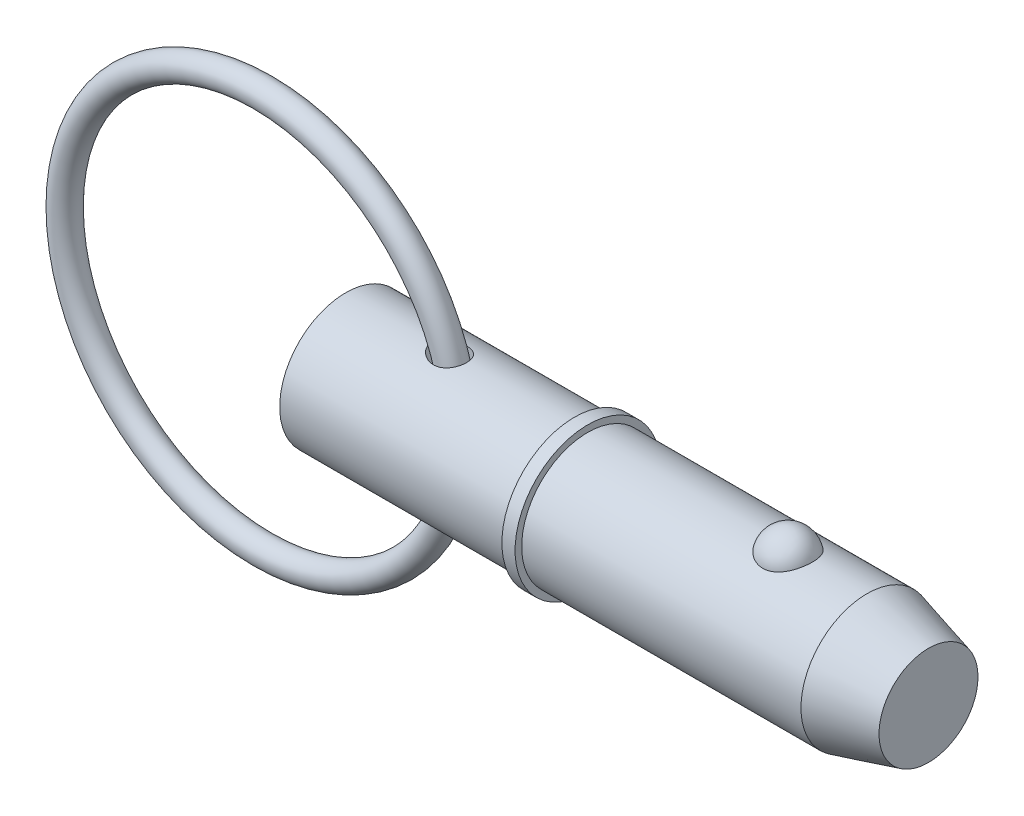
ISO-10303-21;
HEADER;
FILE_DESCRIPTION(('STEP AP214'),'2;1');
FILE_NAME('part.step','',(''),(''),'','','');
FILE_SCHEMA(('AUTOMOTIVE_DESIGN { 1 0 10303 214 1 1 1 1 }'));
ENDSEC;
DATA;
#1=APPLICATION_CONTEXT('core data for automotive mechanical design processes');
#2=APPLICATION_PROTOCOL_DEFINITION('international standard','automotive_design',2000,#1);
#3=PRODUCT_CONTEXT('',#1,'mechanical');
#4=PRODUCT('Part','Part','',(#3));
#5=PRODUCT_RELATED_PRODUCT_CATEGORY('part','',(#4));
#6=PRODUCT_DEFINITION_FORMATION('','',#4);
#7=PRODUCT_DEFINITION_CONTEXT('part definition',#1,'design');
#8=PRODUCT_DEFINITION('design','',#6,#7);
#9=PRODUCT_DEFINITION_SHAPE('','',#8);
#10=(LENGTH_UNIT() NAMED_UNIT(*) SI_UNIT(.MILLI.,.METRE.));
#11=(NAMED_UNIT(*) PLANE_ANGLE_UNIT() SI_UNIT($,.RADIAN.));
#12=(NAMED_UNIT(*) SI_UNIT($,.STERADIAN.) SOLID_ANGLE_UNIT());
#13=UNCERTAINTY_MEASURE_WITH_UNIT(LENGTH_MEASURE(1.E-05),#10,'distance_accuracy_value','');
#14=(GEOMETRIC_REPRESENTATION_CONTEXT(3) GLOBAL_UNCERTAINTY_ASSIGNED_CONTEXT((#13)) GLOBAL_UNIT_ASSIGNED_CONTEXT((#10,
#11,#12)) REPRESENTATION_CONTEXT('',''));
#15=CARTESIAN_POINT('',(0.,0.,0.));
#16=DIRECTION('',(0.,0.,1.));
#17=DIRECTION('',(1.,0.,0.));
#18=AXIS2_PLACEMENT_3D('',#15,#16,#17);
#19=CARTESIAN_POINT('',(-11.9894358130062,0.,0.));
#20=DIRECTION('',(0.,0.,1.));
#21=DIRECTION('',(1.,0.,0.));
#22=AXIS2_PLACEMENT_3D('',#19,#20,#21);
#23=TOROIDAL_SURFACE('',#22,28.575,1.905);
#24=CARTESIAN_POINT('',(18.4905641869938,0.,0.));
#25=VERTEX_POINT('',#24);
#26=VERTEX_LOOP('',#25);
#27=FACE_BOUND('',#26,.T.);
#28=ADVANCED_FACE('P0_F12',(#27),#23,.T.);
#29=CLOSED_SHELL('',(#28));
#30=MANIFOLD_SOLID_BREP('P0_B1',#29);
#31=CARTESIAN_POINT('',(0.,0.,0.));
#32=DIRECTION('',(1.,0.,0.));
#33=DIRECTION('',(0.,0.,-1.));
#34=AXIS2_PLACEMENT_3D('',#31,#32,#33);
#35=CYLINDRICAL_SURFACE('',#34,9.525);
#36=CARTESIAN_POINT('',(12.9513882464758,9.41921920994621,-1.41559473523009));
#37=CARTESIAN_POINT('',(13.0504692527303,9.40163924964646,-1.53256769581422));
#38=CARTESIAN_POINT('',(13.1602600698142,9.38319823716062,-1.6404459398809));
#39=CARTESIAN_POINT('',(13.3966485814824,9.34687220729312,-1.83618480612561));
#40=CARTESIAN_POINT('',(13.5232761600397,9.32898824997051,-1.92400906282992));
#41=CARTESIAN_POINT('',(13.78900694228,9.29593183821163,-2.07784697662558));
#42=CARTESIAN_POINT('',(13.9280753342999,9.28075215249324,-2.14391921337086));
#43=CARTESIAN_POINT('',(14.2153444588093,9.25488828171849,-2.25295850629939));
#44=CARTESIAN_POINT('',(14.3635415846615,9.24420233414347,-2.29593462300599));
#45=CARTESIAN_POINT('',(14.669669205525,9.22859713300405,-2.3579005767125));
#46=CARTESIAN_POINT('',(14.8277567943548,9.22385123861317,-2.37617053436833));
#47=CARTESIAN_POINT('',(15.1447573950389,9.22170813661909,-2.38448481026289));
#48=CARTESIAN_POINT('',(15.3036699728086,9.22430739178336,-2.3745427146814));
#49=CARTESIAN_POINT('',(15.6046561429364,9.2363636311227,-2.32717331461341));
#50=CARTESIAN_POINT('',(15.7470893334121,9.24528216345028,-2.29190131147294));
#51=CARTESIAN_POINT('',(16.0228763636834,9.26842607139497,-2.19642882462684));
#52=CARTESIAN_POINT('',(16.1562346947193,9.28264879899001,-2.1362407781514));
#53=CARTESIAN_POINT('',(16.3991522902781,9.31332263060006,-1.99805318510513));
#54=CARTESIAN_POINT('',(16.5097585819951,9.32951023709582,-1.92182839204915));
#55=CARTESIAN_POINT('',(16.7159974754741,9.36298467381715,-1.75147176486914));
#56=CARTESIAN_POINT('',(16.811631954,9.38027136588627,-1.65734217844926));
#57=CARTESIAN_POINT('',(16.9833240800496,9.41356881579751,-1.45618916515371));
#58=CARTESIAN_POINT('',(17.0597719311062,9.42959946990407,-1.34950141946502));
#59=CARTESIAN_POINT('',(17.1939538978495,9.45905380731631,-1.12462011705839));
#60=CARTESIAN_POINT('',(17.2516877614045,9.4724774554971,-1.00642640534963));
#61=CARTESIAN_POINT('',(17.3474400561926,9.49535683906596,-0.760990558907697));
#62=CARTESIAN_POINT('',(17.3853184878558,9.50478431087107,-0.633691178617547));
#63=CARTESIAN_POINT('',(17.4399027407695,9.51852575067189,-0.374363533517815));
#64=CARTESIAN_POINT('',(17.4566077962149,9.52283953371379,-0.242335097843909));
#65=CARTESIAN_POINT('',(17.4685150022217,9.52590431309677,0.0235692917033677));
#66=CARTESIAN_POINT('',(17.4635842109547,9.52462091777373,0.157451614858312));
#67=CARTESIAN_POINT('',(17.4320243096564,9.5165501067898,0.422467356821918));
#68=CARTESIAN_POINT('',(17.4053947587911,9.50976257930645,0.55360071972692));
#69=CARTESIAN_POINT('',(17.3310009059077,9.49140797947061,0.809490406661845));
#70=CARTESIAN_POINT('',(17.2832204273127,9.47983724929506,0.934241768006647));
#71=CARTESIAN_POINT('',(17.1676219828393,9.453180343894,1.1736825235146));
#72=CARTESIAN_POINT('',(17.0998044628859,9.43809424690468,1.28837214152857));
#73=CARTESIAN_POINT('',(16.9461013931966,9.40614962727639,1.50393386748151));
#74=CARTESIAN_POINT('',(16.8602910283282,9.38929862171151,1.6048606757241));
#75=CARTESIAN_POINT('',(16.6726759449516,9.35566510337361,1.79055313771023));
#76=CARTESIAN_POINT('',(16.5708731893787,9.33888258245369,1.87532077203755));
#77=CARTESIAN_POINT('',(16.3550631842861,9.30741331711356,2.02572386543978));
#78=CARTESIAN_POINT('',(16.2411701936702,9.29270956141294,2.09151983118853));
#79=CARTESIAN_POINT('',(16.0037488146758,9.26681293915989,2.20343355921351));
#80=CARTESIAN_POINT('',(15.8802207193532,9.25561996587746,2.24955191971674));
#81=CARTESIAN_POINT('',(15.6262451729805,9.23779438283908,2.32167613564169));
#82=CARTESIAN_POINT('',(15.4957570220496,9.23119272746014,2.34754561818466));
#83=CARTESIAN_POINT('',(15.2322153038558,9.22318493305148,2.37881082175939));
#84=CARTESIAN_POINT('',(15.0991611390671,9.22178001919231,2.38420171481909));
#85=CARTESIAN_POINT('',(14.8267609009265,9.22414647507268,2.37503099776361));
#86=CARTESIAN_POINT('',(14.6874545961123,9.22819578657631,2.35939810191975));
#87=CARTESIAN_POINT('',(14.412976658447,9.24129253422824,2.30756034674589));
#88=CARTESIAN_POINT('',(14.2778066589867,9.25034191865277,2.27134746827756));
#89=CARTESIAN_POINT('',(14.0027915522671,9.27334688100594,2.1756145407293));
#90=CARTESIAN_POINT('',(13.8635960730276,9.28766658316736,2.11431132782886));
#91=CARTESIAN_POINT('',(13.5969045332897,9.31925368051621,1.97041856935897));
#92=CARTESIAN_POINT('',(13.4694182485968,9.33652350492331,1.88781145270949));
#93=CARTESIAN_POINT('',(13.2243568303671,9.37286659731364,1.69844580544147));
#94=CARTESIAN_POINT('',(13.1075060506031,9.39198626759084,1.59075211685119));
#95=CARTESIAN_POINT('',(12.8957171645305,9.42881110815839,1.35544651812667));
#96=CARTESIAN_POINT('',(12.8007455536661,9.44651841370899,1.22786557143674));
#97=CARTESIAN_POINT('',(12.6580495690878,9.4741137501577,0.9887243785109));
#98=CARTESIAN_POINT('',(12.604453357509,9.4848570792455,0.880756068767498));
#99=CARTESIAN_POINT('',(12.515693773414,9.50295777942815,0.657225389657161));
#100=CARTESIAN_POINT('',(12.4805142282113,9.51031812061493,0.541669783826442));
#101=CARTESIAN_POINT('',(12.4305797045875,9.52083647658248,0.305475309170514));
#102=CARTESIAN_POINT('',(12.4159122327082,9.52397648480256,0.18481691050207));
#103=CARTESIAN_POINT('',(12.408320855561,9.52559626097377,-0.0572308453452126));
#104=CARTESIAN_POINT('',(12.4153963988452,9.52407614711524,-0.178620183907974));
#105=CARTESIAN_POINT('',(12.4495068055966,9.51684301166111,-0.409566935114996));
#106=CARTESIAN_POINT('',(12.4750931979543,9.51143444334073,-0.519353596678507));
#107=CARTESIAN_POINT('',(12.543120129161,9.49733710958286,-0.73328523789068));
#108=CARTESIAN_POINT('',(12.5855568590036,9.4886490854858,-0.837431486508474));
#109=CARTESIAN_POINT('',(12.6780792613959,9.47023833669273,-1.02356028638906));
#110=CARTESIAN_POINT('',(12.7261842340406,9.46084463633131,-1.10657511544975));
#111=CARTESIAN_POINT('',(12.8319313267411,9.44081892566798,-1.26610577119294));
#112=CARTESIAN_POINT('',(12.8895756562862,9.43018662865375,-1.34262008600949));
#113=CARTESIAN_POINT('',(12.9513882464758,9.41921920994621,-1.41559473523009));
#114=B_SPLINE_CURVE_WITH_KNOTS('',3,(#36,#37,#38,#39,#40,#41,#42,#43,#44,#45,#46,#47,#48,#49,
#50,#51,#52,#53,#54,#55,#56,#57,#58,#59,#60,#61,#62,#63,#64,#65,#66,#67,#68,#69,#70,#71,#72,#73,
#74,#75,#76,#77,#78,#79,#80,#81,#82,#83,#84,#85,#86,#87,#88,#89,#90,#91,#92,#93,#94,#95,#96,#97,
#98,#99,#100,#101,#102,#103,#104,#105,#106,#107,#108,#109,#110,#111,#112,#113),.UNSPECIFIED.,
.T.,.F.,(4,2,2,2,2,2,2,2,2,2,2,2,2,2,2,2,2,2,2,2,2,2,2,2,2,2,2,2,2,2,2,2,2,2,2,2,2,2,4),(0.,
0.462524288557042,0.925880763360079,1.3879789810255,1.8498957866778,2.3250010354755,
2.79987752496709,3.23851602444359,3.67693583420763,4.08084875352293,4.48471100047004,
4.87953549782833,5.27436531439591,5.67194282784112,6.0695347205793,6.46957303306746,
6.86961947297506,7.26997240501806,7.67031642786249,8.06901977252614,8.46767421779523,
8.86284969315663,9.25801315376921,9.65581560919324,10.0537118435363,10.4726706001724,
10.8917927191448,11.3481090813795,11.8048030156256,12.2824769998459,12.7594145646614,
13.1209614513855,13.4821903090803,13.8449555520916,14.2077115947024,14.5447865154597,
14.881785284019,15.170268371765,15.4588183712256),.UNSPECIFIED.);
#115=CARTESIAN_POINT('',(12.9513882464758,9.41921920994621,-1.41559473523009));
#116=VERTEX_POINT('',#115);
#117=EDGE_CURVE('P1_E42',#116,#116,#114,.T.);
#118=ORIENTED_EDGE('',*,*,#117,.T.);
#119=EDGE_LOOP('',(#118));
#120=FACE_BOUND('',#119,.T.);
#121=CARTESIAN_POINT('',(0.,0.,0.));
#122=DIRECTION('',(1.,0.,0.));
#123=DIRECTION('',(0.,0.,-1.));
#124=AXIS2_PLACEMENT_3D('',#121,#122,#123);
#125=CIRCLE('',#124,9.525);
#126=CARTESIAN_POINT('',(0.,0.,-9.525));
#127=VERTEX_POINT('',#126);
#128=EDGE_CURVE('P1_E9',#127,#127,#125,.T.);
#129=ORIENTED_EDGE('',*,*,#128,.T.);
#130=EDGE_LOOP('',(#129));
#131=FACE_BOUND('',#130,.T.);
#132=CARTESIAN_POINT('',(33.025,0.,0.));
#133=DIRECTION('',(1.,0.,0.));
#134=DIRECTION('',(0.,0.,-1.));
#135=AXIS2_PLACEMENT_3D('',#132,#133,#134);
#136=CIRCLE('',#135,9.525);
#137=CARTESIAN_POINT('',(33.025,0.,-9.525));
#138=VERTEX_POINT('',#137);
#139=EDGE_CURVE('P1_E25',#138,#138,#136,.T.);
#140=ORIENTED_EDGE('',*,*,#139,.F.);
#141=EDGE_LOOP('',(#140));
#142=FACE_BOUND('',#141,.T.);
#143=CARTESIAN_POINT('',(12.9513882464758,-9.41921920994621,-1.41559473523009));
#144=CARTESIAN_POINT('',(12.8706569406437,-9.43354320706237,-1.32028288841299));
#145=CARTESIAN_POINT('',(12.7970077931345,-9.44729974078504,-1.21890449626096));
#146=CARTESIAN_POINT('',(12.6667099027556,-9.47239055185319,-1.00546491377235));
#147=CARTESIAN_POINT('',(12.6100480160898,-9.48372669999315,-0.893412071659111));
#148=CARTESIAN_POINT('',(12.5163428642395,-9.50281544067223,-0.66020233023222));
#149=CARTESIAN_POINT('',(12.4794216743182,-9.51054569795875,-0.538993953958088));
#150=CARTESIAN_POINT('',(12.4282252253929,-9.52133525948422,-0.29167282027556));
#151=CARTESIAN_POINT('',(12.4139371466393,-9.52439720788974,-0.165562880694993));
#152=CARTESIAN_POINT('',(12.4092595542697,-9.52539668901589,0.0763263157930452));
#153=CARTESIAN_POINT('',(12.4169377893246,-9.5237485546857,0.192070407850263));
#154=CARTESIAN_POINT('',(12.4515961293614,-9.51640070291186,0.420478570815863));
#155=CARTESIAN_POINT('',(12.4785770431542,-9.51070081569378,0.533142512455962));
#156=CARTESIAN_POINT('',(12.5496371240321,-9.49599978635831,0.750537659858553));
#157=CARTESIAN_POINT('',(12.5934215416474,-9.48705569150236,0.855370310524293));
#158=CARTESIAN_POINT('',(12.6960201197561,-9.46670226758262,1.05710432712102));
#159=CARTESIAN_POINT('',(12.754838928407,-9.45529217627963,1.15400322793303));
#160=CARTESIAN_POINT('',(12.8926588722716,-9.42958102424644,1.34883014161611));
#161=CARTESIAN_POINT('',(12.9731843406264,-9.41509922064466,1.44565277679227));
#162=CARTESIAN_POINT('',(13.1473692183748,-9.38554264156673,1.62653953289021));
#163=CARTESIAN_POINT('',(13.2410364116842,-9.37046751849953,1.71059603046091));
#164=CARTESIAN_POINT('',(13.4543924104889,-9.33867330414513,1.87697964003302));
#165=CARTESIAN_POINT('',(13.5758667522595,-9.32205896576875,1.95704323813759));
#166=CARTESIAN_POINT('',(13.8299208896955,-9.29140277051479,2.09777392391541));
#167=CARTESIAN_POINT('',(13.9625074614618,-9.27736250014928,2.15842906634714));
#168=CARTESIAN_POINT('',(14.2477938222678,-9.25234849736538,2.26337318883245));
#169=CARTESIAN_POINT('',(14.4012368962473,-9.2417532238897,2.30575283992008));
#170=CARTESIAN_POINT('',(14.7134258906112,-9.22706044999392,2.36387471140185));
#171=CARTESIAN_POINT('',(14.8721705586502,-9.22296142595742,2.37962317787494));
#172=CARTESIAN_POINT('',(15.1841930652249,-9.22219798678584,2.38258156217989));
#173=CARTESIAN_POINT('',(15.3374581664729,-9.22526675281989,2.37081567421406));
#174=CARTESIAN_POINT('',(15.6390558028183,-9.23821642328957,2.31984408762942));
#175=CARTESIAN_POINT('',(15.7873916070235,-9.24809271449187,2.28065697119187));
#176=CARTESIAN_POINT('',(16.0605055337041,-9.27231045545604,2.17997072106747));
#177=CARTESIAN_POINT('',(16.1861988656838,-9.28616347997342,2.12082794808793));
#178=CARTESIAN_POINT('',(16.4248737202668,-9.31689725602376,1.9814435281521));
#179=CARTESIAN_POINT('',(16.5378583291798,-9.33377726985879,1.90120701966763));
#180=CARTESIAN_POINT('',(16.7424913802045,-9.36766057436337,1.72629138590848));
#181=CARTESIAN_POINT('',(16.8349077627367,-9.38461836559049,1.63249912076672));
#182=CARTESIAN_POINT('',(17.0025959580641,-9.41752009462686,1.43052052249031));
#183=CARTESIAN_POINT('',(17.0778684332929,-9.43346407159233,1.32233474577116));
#184=CARTESIAN_POINT('',(17.2093311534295,-9.46256896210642,1.09477833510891));
#185=CARTESIAN_POINT('',(17.2655443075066,-9.47573320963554,0.975421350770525));
#186=CARTESIAN_POINT('',(17.3577240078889,-9.49788660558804,0.728764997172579));
#187=CARTESIAN_POINT('',(17.3936897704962,-9.5068755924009,0.601465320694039));
#188=CARTESIAN_POINT('',(17.4447894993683,-9.51977728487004,0.341392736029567));
#189=CARTESIAN_POINT('',(17.4597470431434,-9.52364698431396,0.208583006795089));
#190=CARTESIAN_POINT('',(17.467935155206,-9.52575588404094,-0.0577507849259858));
#191=CARTESIAN_POINT('',(17.4611651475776,-9.52399493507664,-0.191274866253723));
#192=CARTESIAN_POINT('',(17.4259933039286,-9.51501704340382,-0.455658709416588));
#193=CARTESIAN_POINT('',(17.3975278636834,-9.50778405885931,-0.586509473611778));
#194=CARTESIAN_POINT('',(17.3195245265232,-9.48862442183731,-0.841413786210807));
#195=CARTESIAN_POINT('',(17.2699864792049,-9.47669773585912,-0.965467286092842));
#196=CARTESIAN_POINT('',(17.1510794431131,-9.44947793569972,-1.20302860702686));
#197=CARTESIAN_POINT('',(17.0817421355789,-9.43419020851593,-1.31655289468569));
#198=CARTESIAN_POINT('',(16.9249035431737,-9.40193593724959,-1.52999797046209));
#199=CARTESIAN_POINT('',(16.8374037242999,-9.38496952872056,-1.62991985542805));
#200=CARTESIAN_POINT('',(16.6472525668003,-9.35139745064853,-1.81261591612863));
#201=CARTESIAN_POINT('',(16.544718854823,-9.33479003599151,-1.89551219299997));
#202=CARTESIAN_POINT('',(16.3268885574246,-9.30366076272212,-2.04284430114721));
#203=CARTESIAN_POINT('',(16.2115933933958,-9.28913867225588,-2.10728218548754));
#204=CARTESIAN_POINT('',(15.9721327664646,-9.26380878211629,-2.21598517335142));
#205=CARTESIAN_POINT('',(15.8480095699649,-9.25298455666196,-2.26033977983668));
#206=CARTESIAN_POINT('',(15.5939970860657,-9.23601616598,-2.32870721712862));
#207=CARTESIAN_POINT('',(15.4641070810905,-9.22987258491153,-2.35271750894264));
#208=CARTESIAN_POINT('',(15.1982340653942,-9.22261892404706,-2.38099747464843));
#209=CARTESIAN_POINT('',(15.0621840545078,-9.22166165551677,-2.38466791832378));
#210=CARTESIAN_POINT('',(14.7911713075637,-9.22504733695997,-2.37153091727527));
#211=CARTESIAN_POINT('',(14.6562088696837,-9.2293916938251,-2.35471803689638));
#212=CARTESIAN_POINT('',(14.3799999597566,-9.24325361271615,-2.29972931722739));
#213=CARTESIAN_POINT('',(14.2390842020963,-9.25314817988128,-2.2599897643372));
#214=CARTESIAN_POINT('',(13.9651910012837,-9.27709186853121,-2.15959208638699));
#215=CARTESIAN_POINT('',(13.8322212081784,-9.29114491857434,-2.09891417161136));
#216=CARTESIAN_POINT('',(13.5621642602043,-9.32369066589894,-1.94960068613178));
#217=CARTESIAN_POINT('',(13.4264724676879,-9.34251276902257,-1.85849626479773));
#218=CARTESIAN_POINT('',(13.1736579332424,-9.38095091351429,-1.6535412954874));
#219=CARTESIAN_POINT('',(13.0565182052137,-9.40056620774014,-1.53971177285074));
#220=CARTESIAN_POINT('',(12.9513882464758,-9.41921920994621,-1.41559473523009));
#221=B_SPLINE_CURVE_WITH_KNOTS('',3,(#143,#144,#145,#146,#147,#148,#149,#150,#151,#152,#153,
#154,#155,#156,#157,#158,#159,#160,#161,#162,#163,#164,#165,#166,#167,#168,#169,#170,#171,#172,
#173,#174,#175,#176,#177,#178,#179,#180,#181,#182,#183,#184,#185,#186,#187,#188,#189,#190,#191,
#192,#193,#194,#195,#196,#197,#198,#199,#200,#201,#202,#203,#204,#205,#206,#207,#208,#209,#210,
#211,#212,#213,#214,#215,#216,#217,#218,#219,#220),.UNSPECIFIED.,.T.,.F.,(4,2,2,2,2,2,2,2,2,2,2,
2,2,2,2,2,2,2,2,2,2,2,2,2,2,2,2,2,2,2,2,2,2,2,2,2,2,2,4),(0.,0.376746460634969,0.75320065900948,
1.13195666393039,1.51049805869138,1.85679105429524,2.20309856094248,2.54359033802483,
2.88418751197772,3.26301611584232,3.64207005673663,4.07954912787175,4.51729693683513,
4.99355673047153,5.46970480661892,5.92841231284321,6.38680927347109,6.80346940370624,
7.22002812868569,7.61642768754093,8.01281192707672,8.40871801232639,8.80463942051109,
9.20386620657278,9.60310357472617,10.0035159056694,10.4039310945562,10.8037091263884,
11.2034549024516,11.6002252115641,11.9969513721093,12.3918916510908,12.7868812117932,
13.1934480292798,13.6001227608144,14.038511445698,14.4773156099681,14.9683748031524,
15.4589817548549),.UNSPECIFIED.);
#222=CARTESIAN_POINT('',(12.9513882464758,-9.41921920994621,-1.41559473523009));
#223=VERTEX_POINT('',#222);
#224=EDGE_CURVE('P1_E17',#223,#223,#221,.T.);
#225=ORIENTED_EDGE('',*,*,#224,.T.);
#226=EDGE_LOOP('',(#225));
#227=FACE_BOUND('',#226,.T.);
#228=ADVANCED_FACE('P1_F13',(#120,#131,#142,#227),#35,.T.);
#229=CARTESIAN_POINT('',(0.,0.,0.));
#230=DIRECTION('',(1.,0.,0.));
#231=DIRECTION('',(0.,0.,-1.));
#232=AXIS2_PLACEMENT_3D('',#229,#230,#231);
#233=CYLINDRICAL_SURFACE('',#232,9.525);
#234=CARTESIAN_POINT('',(75.2430540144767,0.,0.));
#235=DIRECTION('',(1.,0.,0.));
#236=DIRECTION('',(0.,0.,-1.));
#237=AXIS2_PLACEMENT_3D('',#234,#235,#236);
#238=CIRCLE('',#237,9.525);
#239=CARTESIAN_POINT('',(75.2430540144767,0.,-9.525));
#240=VERTEX_POINT('',#239);
#241=EDGE_CURVE('P1_E99',#240,#240,#238,.T.);
#242=ORIENTED_EDGE('',*,*,#241,.F.);
#243=EDGE_LOOP('',(#242));
#244=FACE_BOUND('',#243,.T.);
#245=CARTESIAN_POINT('',(34.93,0.,0.));
#246=DIRECTION('',(1.,0.,0.));
#247=DIRECTION('',(0.,0.,-1.));
#248=AXIS2_PLACEMENT_3D('',#245,#246,#247);
#249=CIRCLE('',#248,9.525);
#250=CARTESIAN_POINT('',(34.93,0.,-9.525));
#251=VERTEX_POINT('',#250);
#252=EDGE_CURVE('P1_E96',#251,#251,#249,.T.);
#253=ORIENTED_EDGE('',*,*,#252,.T.);
#254=EDGE_LOOP('',(#253));
#255=FACE_BOUND('',#254,.T.);
#256=CARTESIAN_POINT('',(63.8457573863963,8.80405803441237,3.63513233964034));
#257=CARTESIAN_POINT('',(63.7516766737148,8.80405953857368,3.63513053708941));
#258=CARTESIAN_POINT('',(63.6575618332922,8.80561325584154,3.63137461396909));
#259=CARTESIAN_POINT('',(63.4700126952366,8.81177748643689,3.61638665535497));
#260=CARTESIAN_POINT('',(63.3765788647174,8.81638992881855,3.60514990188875));
#261=CARTESIAN_POINT('',(63.0979452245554,8.83467114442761,3.56024627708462));
#262=CARTESIAN_POINT('',(62.9146916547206,8.85278327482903,3.5153862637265));
#263=CARTESIAN_POINT('',(62.559509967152,8.89871214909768,3.39742145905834));
#264=CARTESIAN_POINT('',(62.3875533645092,8.92650327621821,3.32439116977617));
#265=CARTESIAN_POINT('',(62.058707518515,8.9887481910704,3.15220244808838));
#266=CARTESIAN_POINT('',(61.9018114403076,9.02319893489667,3.05305594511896));
#267=CARTESIAN_POINT('',(61.6022147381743,9.09629186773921,2.82797815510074));
#268=CARTESIAN_POINT('',(61.4600600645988,9.13502685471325,2.70135138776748));
#269=CARTESIAN_POINT('',(61.1982999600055,9.2118657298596,2.42641932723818));
#270=CARTESIAN_POINT('',(61.0787015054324,9.24996941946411,2.27810735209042));
#271=CARTESIAN_POINT('',(60.859645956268,9.32341082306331,1.95652290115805));
#272=CARTESIAN_POINT('',(60.7613174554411,9.35855090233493,1.78243511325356));
#273=CARTESIAN_POINT('',(60.5938190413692,9.42045142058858,1.41937246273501));
#274=CARTESIAN_POINT('',(60.5246511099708,9.44721128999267,1.23039658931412));
#275=CARTESIAN_POINT('',(60.4161994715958,9.48990641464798,0.840370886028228));
#276=CARTESIAN_POINT('',(60.3772880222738,9.50570658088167,0.639202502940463));
#277=CARTESIAN_POINT('',(60.3315550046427,9.52433146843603,0.23266436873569));
#278=CARTESIAN_POINT('',(60.3247324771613,9.52715657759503,0.0272947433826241));
#279=CARTESIAN_POINT('',(60.343255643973,9.51956918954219,-0.380478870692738));
#280=CARTESIAN_POINT('',(60.3684052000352,9.50923740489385,-0.582893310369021));
#281=CARTESIAN_POINT('',(60.45002537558,9.47651897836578,-0.980293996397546));
#282=CARTESIAN_POINT('',(60.5064966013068,9.45413210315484,-1.17528009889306));
#283=CARTESIAN_POINT('',(60.6497192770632,9.39954044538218,-1.55263697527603));
#284=CARTESIAN_POINT('',(60.7365124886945,9.36732213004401,-1.73498993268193));
#285=CARTESIAN_POINT('',(60.9386103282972,9.29640700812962,-2.08177763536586));
#286=CARTESIAN_POINT('',(61.0539172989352,9.25770966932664,-2.24621090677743));
#287=CARTESIAN_POINT('',(61.311264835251,9.17775604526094,-2.5533833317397));
#288=CARTESIAN_POINT('',(61.4534344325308,9.136488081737,-2.696011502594));
#289=CARTESIAN_POINT('',(61.76089985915,9.05620497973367,-2.95451229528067));
#290=CARTESIAN_POINT('',(61.926193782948,9.01718965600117,-3.07038711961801));
#291=CARTESIAN_POINT('',(62.272052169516,8.94680019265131,-3.26976836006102));
#292=CARTESIAN_POINT('',(62.4522278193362,8.91528408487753,-3.353897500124));
#293=CARTESIAN_POINT('',(62.8256514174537,8.86272514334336,-3.49043503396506));
#294=CARTESIAN_POINT('',(63.018894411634,8.84167836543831,-3.54285537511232));
#295=CARTESIAN_POINT('',(63.4025036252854,8.81348056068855,-3.61241306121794));
#296=CARTESIAN_POINT('',(63.5925251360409,8.80568348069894,-3.6311933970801));
#297=CARTESIAN_POINT('',(63.9731906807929,8.80289410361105,-3.63795342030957));
#298=CARTESIAN_POINT('',(64.1638345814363,8.80789922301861,-3.62593932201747));
#299=CARTESIAN_POINT('',(64.534007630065,8.82974915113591,-3.57238430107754));
#300=CARTESIAN_POINT('',(64.7136976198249,8.84621463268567,-3.53178890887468));
#301=CARTESIAN_POINT('',(65.063422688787,8.88875330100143,-3.42331083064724));
#302=CARTESIAN_POINT('',(65.2334569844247,8.91482726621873,-3.35542593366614));
#303=CARTESIAN_POINT('',(65.5632377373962,8.97448239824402,-3.19248225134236));
#304=CARTESIAN_POINT('',(65.7226801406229,9.00821446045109,-3.0968647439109));
#305=CARTESIAN_POINT('',(66.0235136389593,9.07935398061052,-2.88162736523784));
#306=CARTESIAN_POINT('',(66.1649005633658,9.11676228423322,-2.76200196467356));
#307=CARTESIAN_POINT('',(66.4333193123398,9.19347419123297,-2.49516285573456));
#308=CARTESIAN_POINT('',(66.5592750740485,9.23277872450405,-2.34686614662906));
#309=CARTESIAN_POINT('',(66.7855227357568,9.30737610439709,-2.03093683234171));
#310=CARTESIAN_POINT('',(66.8858100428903,9.34266823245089,-1.86330077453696));
#311=CARTESIAN_POINT('',(67.0615149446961,9.40674710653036,-1.50744893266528));
#312=CARTESIAN_POINT('',(67.136041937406,9.43529176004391,-1.31874876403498));
#313=CARTESIAN_POINT('',(67.2541650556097,9.48144132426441,-0.930631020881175));
#314=CARTESIAN_POINT('',(67.2977608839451,9.49904612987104,-0.731213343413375));
#315=CARTESIAN_POINT('',(67.3531580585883,9.5215314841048,-0.327147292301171));
#316=CARTESIAN_POINT('',(67.3649354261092,9.52640243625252,-0.122495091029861));
#317=CARTESIAN_POINT('',(67.3563825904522,9.5228957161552,0.286018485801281));
#318=CARTESIAN_POINT('',(67.3360530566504,9.5145183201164,0.489879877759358));
#319=CARTESIAN_POINT('',(67.2638840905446,9.48544083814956,0.889994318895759));
#320=CARTESIAN_POINT('',(67.2121993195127,9.46480124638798,1.08627971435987));
#321=CARTESIAN_POINT('',(67.0784917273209,9.4133389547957,1.46682086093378));
#322=CARTESIAN_POINT('',(66.9964668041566,9.38251554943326,1.65107577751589));
#323=CARTESIAN_POINT('',(66.8031929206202,9.31365636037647,2.00346348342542));
#324=CARTESIAN_POINT('',(66.6917838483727,9.27558138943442,2.17150083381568));
#325=CARTESIAN_POINT('',(66.4422947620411,9.19638714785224,2.48563115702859));
#326=CARTESIAN_POINT('',(66.3042163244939,9.15526805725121,2.63172542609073));
#327=CARTESIAN_POINT('',(66.0048438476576,9.07465393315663,2.89750997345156));
#328=CARTESIAN_POINT('',(65.8436109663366,9.03515496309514,3.01726776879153));
#329=CARTESIAN_POINT('',(65.5016136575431,8.96227564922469,3.22732920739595));
#330=CARTESIAN_POINT('',(65.320841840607,8.92889763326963,3.31762165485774));
#331=CARTESIAN_POINT('',(64.9514451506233,8.8734538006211,3.46314419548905));
#332=CARTESIAN_POINT('',(64.7633237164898,8.85102983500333,3.51950082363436));
#333=CARTESIAN_POINT('',(64.4757869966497,8.8266696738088,3.57993683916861));
#334=CARTESIAN_POINT('',(64.3791339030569,8.82009725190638,3.5960621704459));
#335=CARTESIAN_POINT('',(64.1846770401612,8.81020897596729,3.62022512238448));
#336=CARTESIAN_POINT('',(64.0868741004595,8.80689090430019,3.62826825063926));
#337=CARTESIAN_POINT('',(63.9412243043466,8.80445615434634,3.63416760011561));
#338=CARTESIAN_POINT('',(63.8934952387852,8.80405727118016,3.63513325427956));
#339=CARTESIAN_POINT('',(63.8457573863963,8.80405803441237,3.63513233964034));
#340=B_SPLINE_CURVE_WITH_KNOTS('',3,(#256,#257,#258,#259,#260,#261,#262,#263,#264,#265,#266,
#267,#268,#269,#270,#271,#272,#273,#274,#275,#276,#277,#278,#279,#280,#281,#282,#283,#284,#285,
#286,#287,#288,#289,#290,#291,#292,#293,#294,#295,#296,#297,#298,#299,#300,#301,#302,#303,#304,
#305,#306,#307,#308,#309,#310,#311,#312,#313,#314,#315,#316,#317,#318,#319,#320,#321,#322,#323,
#324,#325,#326,#327,#328,#329,#330,#331,#332,#333,#334,#335,#336,#337,#338,#339),.UNSPECIFIED.,
.T.,.F.,(4,2,2,2,2,2,2,2,2,2,2,2,2,2,2,2,2,2,2,2,2,2,2,2,2,2,2,2,2,2,2,2,2,2,2,2,2,2,2,2,2,4),
(0.,0.282202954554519,0.564584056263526,1.13017050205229,1.69427128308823,2.25811483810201,
2.83836627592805,3.41879688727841,4.02497117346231,4.63118665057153,5.24474754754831,
5.85829010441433,6.46808687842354,7.07789545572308,7.6885472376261,8.29924920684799,
8.9129628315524,9.52662591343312,10.1275338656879,10.7282152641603,11.2986646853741,
11.8689989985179,12.4213015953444,12.973648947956,13.5380053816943,14.1024919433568,
14.6952986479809,15.2882113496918,15.8999469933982,16.5116885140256,17.1238909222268,
17.7360805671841,18.3452748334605,18.9545113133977,19.567138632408,20.179729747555,
20.7907316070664,21.4019653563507,21.9915938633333,22.2859053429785,22.5800161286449,
22.7232098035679),.UNSPECIFIED.);
#341=CARTESIAN_POINT('',(63.8457573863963,8.80405803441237,3.63513233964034));
#342=VERTEX_POINT('',#341);
#343=EDGE_CURVE('P1_E34',#342,#342,#340,.T.);
#344=ORIENTED_EDGE('',*,*,#343,.T.);
#345=EDGE_LOOP('',(#344));
#346=FACE_BOUND('',#345,.T.);
#347=ADVANCED_FACE('P1_F46',(#244,#255,#346),#233,.T.);
#348=CARTESIAN_POINT('',(0.,0.,0.));
#349=DIRECTION('',(-1.,0.,0.));
#350=DIRECTION('',(0.,0.,1.));
#351=AXIS2_PLACEMENT_3D('',#348,#349,#350);
#352=PLANE('',#351);
#353=ORIENTED_EDGE('',*,*,#128,.F.);
#354=EDGE_LOOP('',(#353));
#355=FACE_BOUND('',#354,.T.);
#356=ADVANCED_FACE('P1_F15',(#355),#352,.T.);
#357=CARTESIAN_POINT('',(33.025,9.525,0.));
#358=DIRECTION('',(-1.,0.,0.));
#359=DIRECTION('',(0.,0.,1.));
#360=AXIS2_PLACEMENT_3D('',#357,#358,#359);
#361=PLANE('',#360);
#362=ORIENTED_EDGE('',*,*,#139,.T.);
#363=EDGE_LOOP('',(#362));
#364=FACE_BOUND('',#363,.T.);
#365=CARTESIAN_POINT('',(33.025,0.,0.));
#366=DIRECTION('',(1.,0.,0.));
#367=DIRECTION('',(0.,0.,-1.));
#368=AXIS2_PLACEMENT_3D('',#365,#366,#367);
#369=CIRCLE('',#368,10.4775);
#370=CARTESIAN_POINT('',(33.025,0.,-10.4775));
#371=VERTEX_POINT('',#370);
#372=EDGE_CURVE('P1_E30',#371,#371,#369,.T.);
#373=ORIENTED_EDGE('',*,*,#372,.F.);
#374=EDGE_LOOP('',(#373));
#375=FACE_BOUND('',#374,.T.);
#376=ADVANCED_FACE('P1_F81',(#364,#375),#361,.T.);
#377=CARTESIAN_POINT('',(0.,0.,0.));
#378=DIRECTION('',(1.,0.,0.));
#379=DIRECTION('',(0.,0.,-1.));
#380=AXIS2_PLACEMENT_3D('',#377,#378,#379);
#381=CYLINDRICAL_SURFACE('',#380,10.4775);
#382=ORIENTED_EDGE('',*,*,#372,.T.);
#383=EDGE_LOOP('',(#382));
#384=FACE_BOUND('',#383,.T.);
#385=CARTESIAN_POINT('',(34.93,0.,0.));
#386=DIRECTION('',(1.,0.,0.));
#387=DIRECTION('',(0.,0.,-1.));
#388=AXIS2_PLACEMENT_3D('',#385,#386,#387);
#389=CIRCLE('',#388,10.4775);
#390=CARTESIAN_POINT('',(34.93,0.,-10.4775));
#391=VERTEX_POINT('',#390);
#392=EDGE_CURVE('P1_E95',#391,#391,#389,.T.);
#393=ORIENTED_EDGE('',*,*,#392,.F.);
#394=EDGE_LOOP('',(#393));
#395=FACE_BOUND('',#394,.T.);
#396=ADVANCED_FACE('P1_F68',(#384,#395),#381,.T.);
#397=CARTESIAN_POINT('',(34.93,10.4775,0.));
#398=DIRECTION('',(1.,0.,0.));
#399=DIRECTION('',(0.,0.,-1.));
#400=AXIS2_PLACEMENT_3D('',#397,#398,#399);
#401=PLANE('',#400);
#402=ORIENTED_EDGE('',*,*,#392,.T.);
#403=EDGE_LOOP('',(#402));
#404=FACE_BOUND('',#403,.T.);
#405=ORIENTED_EDGE('',*,*,#252,.F.);
#406=EDGE_LOOP('',(#405));
#407=FACE_BOUND('',#406,.T.);
#408=ADVANCED_FACE('P1_F62',(#404,#407),#401,.T.);
#409=CARTESIAN_POINT('',(84.13,0.,0.));
#410=DIRECTION('',(-1.,0.,0.));
#411=DIRECTION('',(0.,0.,1.));
#412=AXIS2_PLACEMENT_3D('',#409,#410,#411);
#413=CONICAL_SURFACE('',#412,7.14375000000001,0.26179938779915);
#414=ORIENTED_EDGE('',*,*,#241,.T.);
#415=EDGE_LOOP('',(#414));
#416=FACE_BOUND('',#415,.T.);
#417=CARTESIAN_POINT('',(84.13,0.,0.));
#418=DIRECTION('',(1.,0.,0.));
#419=DIRECTION('',(0.,0.,-1.));
#420=AXIS2_PLACEMENT_3D('',#417,#418,#419);
#421=CIRCLE('',#420,7.14375000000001);
#422=CARTESIAN_POINT('',(84.13,0.,-7.14375000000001));
#423=VERTEX_POINT('',#422);
#424=EDGE_CURVE('P1_E41',#423,#423,#421,.T.);
#425=ORIENTED_EDGE('',*,*,#424,.F.);
#426=EDGE_LOOP('',(#425));
#427=FACE_BOUND('',#426,.T.);
#428=ADVANCED_FACE('P1_F59',(#416,#427),#413,.T.);
#429=CARTESIAN_POINT('',(84.13,7.14375000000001,0.));
#430=DIRECTION('',(1.,0.,0.));
#431=DIRECTION('',(0.,0.,-1.));
#432=AXIS2_PLACEMENT_3D('',#429,#430,#431);
#433=PLANE('',#432);
#434=ORIENTED_EDGE('',*,*,#424,.T.);
#435=EDGE_LOOP('',(#434));
#436=FACE_BOUND('',#435,.T.);
#437=ADVANCED_FACE('P1_F55',(#436),#433,.T.);
#438=CARTESIAN_POINT('',(63.8457573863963,8.5725,0.));
#439=DIRECTION('',(-1.,0.,0.));
#440=DIRECTION('',(0.,-1.,0.));
#441=AXIS2_PLACEMENT_3D('',#438,#439,#440);
#442=SPHERICAL_SURFACE('',#441,3.64249999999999);
#443=ORIENTED_EDGE('',*,*,#343,.F.);
#444=EDGE_LOOP('',(#443));
#445=FACE_BOUND('',#444,.T.);
#446=ADVANCED_FACE('P1_F50',(#445),#442,.T.);
#447=CARTESIAN_POINT('',(-11.9894358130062,0.,0.));
#448=DIRECTION('',(0.,0.,1.));
#449=DIRECTION('',(1.,0.,0.));
#450=AXIS2_PLACEMENT_3D('',#447,#448,#449);
#451=TOROIDAL_SURFACE('',#450,28.575,2.38125);
#452=ORIENTED_EDGE('',*,*,#224,.F.);
#453=EDGE_LOOP('',(#452));
#454=FACE_BOUND('',#453,.T.);
#455=ORIENTED_EDGE('',*,*,#117,.F.);
#456=EDGE_LOOP('',(#455));
#457=FACE_BOUND('',#456,.T.);
#458=ADVANCED_FACE('P1_F54',(#454,#457),#451,.F.);
#459=CLOSED_SHELL('',(#228,#347,#356,#376,#396,#408,#428,#437,#446,#458));
#460=MANIFOLD_SOLID_BREP('P1_B1',#459);
#461=ADVANCED_BREP_SHAPE_REPRESENTATION('',(#18,#30,#460),#14);
#462=SHAPE_DEFINITION_REPRESENTATION(#9,#461);
ENDSEC;
END-ISO-10303-21;
